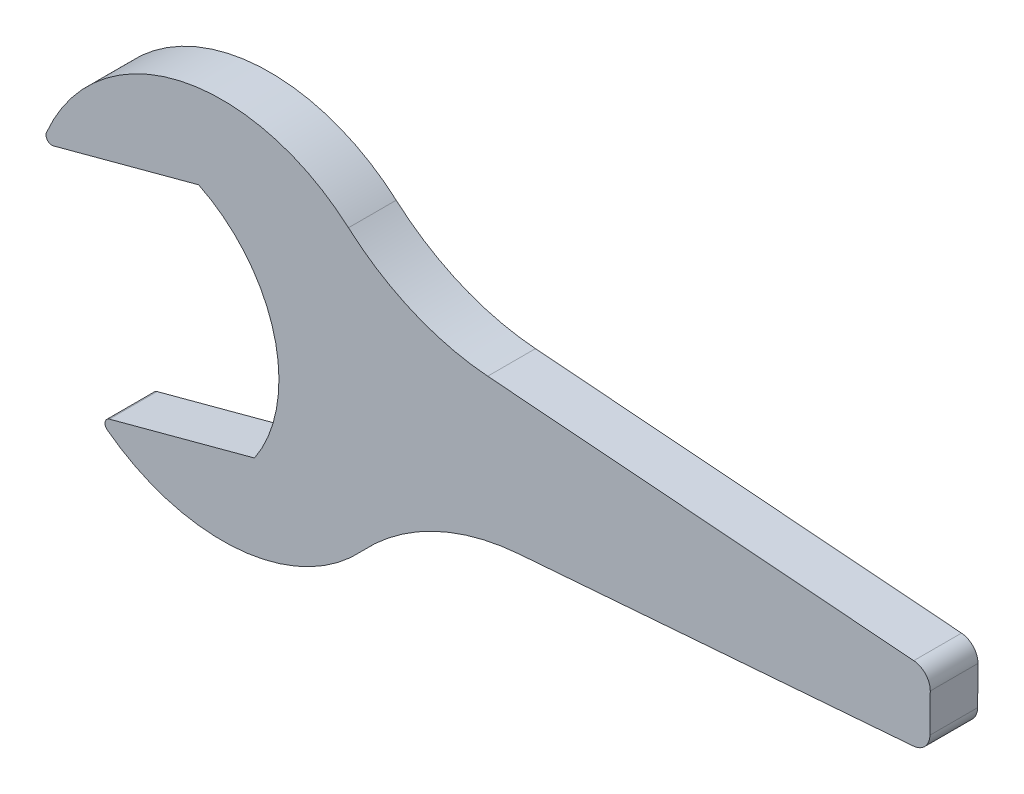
ISO-10303-21;
HEADER;
FILE_DESCRIPTION(('STEP AP214'),'2;1');
FILE_NAME('part.step','',(''),(''),'','','');
FILE_SCHEMA(('AUTOMOTIVE_DESIGN { 1 0 10303 214 1 1 1 1 }'));
ENDSEC;
DATA;
#1=APPLICATION_CONTEXT('core data for automotive mechanical design processes');
#2=APPLICATION_PROTOCOL_DEFINITION('international standard','automotive_design',2000,#1);
#3=PRODUCT_CONTEXT('',#1,'mechanical');
#4=PRODUCT('Part','Part','',(#3));
#5=PRODUCT_RELATED_PRODUCT_CATEGORY('part','',(#4));
#6=PRODUCT_DEFINITION_FORMATION('','',#4);
#7=PRODUCT_DEFINITION_CONTEXT('part definition',#1,'design');
#8=PRODUCT_DEFINITION('design','',#6,#7);
#9=PRODUCT_DEFINITION_SHAPE('','',#8);
#10=(LENGTH_UNIT() NAMED_UNIT(*) SI_UNIT(.MILLI.,.METRE.));
#11=(NAMED_UNIT(*) PLANE_ANGLE_UNIT() SI_UNIT($,.RADIAN.));
#12=(NAMED_UNIT(*) SI_UNIT($,.STERADIAN.) SOLID_ANGLE_UNIT());
#13=UNCERTAINTY_MEASURE_WITH_UNIT(LENGTH_MEASURE(1.E-05),#10,'distance_accuracy_value','');
#14=(GEOMETRIC_REPRESENTATION_CONTEXT(3) GLOBAL_UNCERTAINTY_ASSIGNED_CONTEXT((#13)) GLOBAL_UNIT_ASSIGNED_CONTEXT((#10,
#11,#12)) REPRESENTATION_CONTEXT('',''));
#15=CARTESIAN_POINT('',(0.,0.,0.));
#16=DIRECTION('',(0.,0.,1.));
#17=DIRECTION('',(1.,0.,0.));
#18=AXIS2_PLACEMENT_3D('',#15,#16,#17);
#19=CARTESIAN_POINT('',(550.,29.9775416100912,40.));
#20=DIRECTION('',(-0.999954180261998,0.00957274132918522,0.));
#21=DIRECTION('',(-0.00957274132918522,-0.999954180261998,0.));
#22=AXIS2_PLACEMENT_3D('',#19,#20,#21);
#23=PLANE('',#22);
#24=DIRECTION('',(0.00957274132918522,0.999954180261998,0.));
#25=VECTOR('',#24,1.);
#26=CARTESIAN_POINT('',(550.,29.9775416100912,0.));
#27=LINE('',#26,#25);
#28=CARTESIAN_POINT('',(549.557140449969,-16.2829017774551,0.));
#29=VERTEX_POINT('',#28);
#30=CARTESIAN_POINT('',(549.865918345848,15.9715734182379,0.));
#31=VERTEX_POINT('',#30);
#32=EDGE_CURVE('E171',#29,#31,#27,.T.);
#33=ORIENTED_EDGE('',*,*,#32,.T.);
#34=DIRECTION('',(0.,0.,-1.));
#35=VECTOR('',#34,1.);
#36=CARTESIAN_POINT('',(549.865918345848,15.9715734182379,40.));
#37=LINE('',#36,#35);
#38=CARTESIAN_POINT('',(549.865918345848,15.9715734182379,40.));
#39=VERTEX_POINT('',#38);
#40=EDGE_CURVE('E53',#31,#39,#37,.F.);
#41=ORIENTED_EDGE('',*,*,#40,.T.);
#42=DIRECTION('',(0.00957274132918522,0.999954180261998,0.));
#43=VECTOR('',#42,1.);
#44=CARTESIAN_POINT('',(550.,29.9775416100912,40.));
#45=LINE('',#44,#43);
#46=CARTESIAN_POINT('',(549.557140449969,-16.2829017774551,40.));
#47=VERTEX_POINT('',#46);
#48=EDGE_CURVE('E188',#47,#39,#45,.T.);
#49=ORIENTED_EDGE('',*,*,#48,.F.);
#50=DIRECTION('',(0.,0.,-1.));
#51=VECTOR('',#50,1.);
#52=CARTESIAN_POINT('',(549.557140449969,-16.2829017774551,40.));
#53=LINE('',#52,#51);
#54=EDGE_CURVE('E234',#47,#29,#53,.T.);
#55=ORIENTED_EDGE('',*,*,#54,.T.);
#56=EDGE_LOOP('',(#33,#41,#49,#55));
#57=FACE_BOUND('',#56,.T.);
#58=ADVANCED_FACE('F32',(#57),#23,.F.);
#59=CARTESIAN_POINT('',(96.7492438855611,65.4212925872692,40.));
#60=DIRECTION('',(-0.0779609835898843,-0.996956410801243,0.));
#61=DIRECTION('',(0.996956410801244,-0.0779609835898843,0.));
#62=AXIS2_PLACEMENT_3D('',#59,#60,#61);
#63=PLANE('',#62);
#64=DIRECTION('',(-0.996956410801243,0.0779609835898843,0.));
#65=VECTOR('',#64,1.);
#66=CARTESIAN_POINT('',(96.7492438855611,65.4212925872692,40.));
#67=LINE('',#66,#65);
#68=CARTESIAN_POINT('',(536.036020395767,31.0695107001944,40.));
#69=VERTEX_POINT('',#68);
#70=CARTESIAN_POINT('',(179.030249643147,58.9870011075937,40.));
#71=VERTEX_POINT('',#70);
#72=EDGE_CURVE('E241',#69,#71,#67,.T.);
#73=ORIENTED_EDGE('',*,*,#72,.F.);
#74=DIRECTION('',(0.,0.,-1.));
#75=VECTOR('',#74,1.);
#76=CARTESIAN_POINT('',(536.036020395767,31.0695107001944,40.));
#77=LINE('',#76,#75);
#78=CARTESIAN_POINT('',(536.036020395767,31.0695107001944,0.));
#79=VERTEX_POINT('',#78);
#80=EDGE_CURVE('E227',#69,#79,#77,.T.);
#81=ORIENTED_EDGE('',*,*,#80,.T.);
#82=DIRECTION('',(-0.996956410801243,0.0779609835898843,0.));
#83=VECTOR('',#82,1.);
#84=CARTESIAN_POINT('',(96.7492438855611,65.4212925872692,0.));
#85=LINE('',#84,#83);
#86=CARTESIAN_POINT('',(179.030249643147,58.9870011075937,0.));
#87=VERTEX_POINT('',#86);
#88=EDGE_CURVE('E173',#79,#87,#85,.T.);
#89=ORIENTED_EDGE('',*,*,#88,.T.);
#90=DIRECTION('',(0.,0.,1.));
#91=VECTOR('',#90,1.);
#92=CARTESIAN_POINT('',(179.030249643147,58.9870011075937,40.));
#93=LINE('',#92,#91);
#94=EDGE_CURVE('E215',#87,#71,#93,.T.);
#95=ORIENTED_EDGE('',*,*,#94,.T.);
#96=EDGE_LOOP('',(#73,#81,#89,#95));
#97=FACE_BOUND('',#96,.T.);
#98=ADVANCED_FACE('F245',(#97),#63,.F.);
#99=CARTESIAN_POINT('',(-43.4666621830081,-11.6468570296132,40.));
#100=DIRECTION('',(0.,0.,-1.));
#101=DIRECTION('',(-1.,0.,0.));
#102=AXIS2_PLACEMENT_3D('',#99,#100,#101);
#103=CYLINDRICAL_SURFACE('',#102,160.);
#104=CARTESIAN_POINT('',(-43.4666621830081,-11.6468570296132,40.));
#105=DIRECTION('',(0.,0.,1.));
#106=DIRECTION('',(1.,0.,0.));
#107=AXIS2_PLACEMENT_3D('',#104,#105,#106);
#108=CIRCLE('',#107,160.);
#109=CARTESIAN_POINT('',(62.3507193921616,108.364316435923,40.));
#110=VERTEX_POINT('',#109);
#111=CARTESIAN_POINT('',(-190.710310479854,50.957520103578,40.));
#112=VERTEX_POINT('',#111);
#113=EDGE_CURVE('E146',#110,#112,#108,.T.);
#114=ORIENTED_EDGE('',*,*,#113,.F.);
#115=DIRECTION('',(0.,0.,-1.));
#116=VECTOR('',#115,1.);
#117=CARTESIAN_POINT('',(62.3507193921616,108.364316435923,40.));
#118=LINE('',#117,#116);
#119=CARTESIAN_POINT('',(62.3507193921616,108.364316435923,0.));
#120=VERTEX_POINT('',#119);
#121=EDGE_CURVE('E212',#110,#120,#118,.T.);
#122=ORIENTED_EDGE('',*,*,#121,.T.);
#123=CARTESIAN_POINT('',(-43.4666621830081,-11.6468570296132,0.));
#124=DIRECTION('',(0.,0.,1.));
#125=DIRECTION('',(1.,0.,0.));
#126=AXIS2_PLACEMENT_3D('',#123,#124,#125);
#127=CIRCLE('',#126,160.);
#128=CARTESIAN_POINT('',(-190.710310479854,50.957520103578,0.));
#129=VERTEX_POINT('',#128);
#130=EDGE_CURVE('E175',#120,#129,#127,.T.);
#131=ORIENTED_EDGE('',*,*,#130,.T.);
#132=DIRECTION('',(0.,0.,-1.));
#133=VECTOR('',#132,1.);
#134=CARTESIAN_POINT('',(-190.710310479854,50.9575201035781,40.));
#135=LINE('',#134,#133);
#136=EDGE_CURVE('E204',#129,#112,#135,.F.);
#137=ORIENTED_EDGE('',*,*,#136,.T.);
#138=EDGE_LOOP('',(#114,#122,#131,#137));
#139=FACE_BOUND('',#138,.T.);
#140=ADVANCED_FACE('F289',(#139),#103,.T.);
#141=CARTESIAN_POINT('',(-194.339846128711,41.619289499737,40.));
#142=DIRECTION('',(-0.258819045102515,0.96592582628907,0.));
#143=DIRECTION('',(-0.96592582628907,-0.258819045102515,0.));
#144=AXIS2_PLACEMENT_3D('',#141,#142,#143);
#145=PLANE('',#144);
#146=DIRECTION('',(0.96592582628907,0.258819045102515,0.));
#147=VECTOR('',#146,1.);
#148=CARTESIAN_POINT('',(-194.339846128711,41.619289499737,40.));
#149=LINE('',#148,#147);
#150=CARTESIAN_POINT('',(-184.814851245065,44.1715041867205,40.));
#151=VERTEX_POINT('',#150);
#152=CARTESIAN_POINT('',(-63.2173676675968,76.7534517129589,40.));
#153=VERTEX_POINT('',#152);
#154=EDGE_CURVE('E134',#151,#153,#149,.T.);
#155=ORIENTED_EDGE('',*,*,#154,.F.);
#156=DIRECTION('',(0.,0.,-1.));
#157=VECTOR('',#156,1.);
#158=CARTESIAN_POINT('',(-184.814851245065,44.1715041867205,40.));
#159=LINE('',#158,#157);
#160=CARTESIAN_POINT('',(-184.814851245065,44.1715041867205,0.));
#161=VERTEX_POINT('',#160);
#162=EDGE_CURVE('E202',#151,#161,#159,.T.);
#163=ORIENTED_EDGE('',*,*,#162,.T.);
#164=DIRECTION('',(0.96592582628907,0.258819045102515,0.));
#165=VECTOR('',#164,1.);
#166=CARTESIAN_POINT('',(-194.339846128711,41.619289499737,0.));
#167=LINE('',#166,#165);
#168=CARTESIAN_POINT('',(-63.2173676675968,76.7534517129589,0.));
#169=VERTEX_POINT('',#168);
#170=EDGE_CURVE('E152',#161,#169,#167,.T.);
#171=ORIENTED_EDGE('',*,*,#170,.T.);
#172=DIRECTION('',(0.,0.,-1.));
#173=VECTOR('',#172,1.);
#174=CARTESIAN_POINT('',(-63.2173676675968,76.7534517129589,40.));
#175=LINE('',#174,#173);
#176=EDGE_CURVE('E149',#153,#169,#175,.T.);
#177=ORIENTED_EDGE('',*,*,#176,.F.);
#178=EDGE_LOOP('',(#155,#163,#171,#177));
#179=FACE_BOUND('',#178,.T.);
#180=ADVANCED_FACE('F150',(#179),#145,.F.);
#181=CARTESIAN_POINT('',(-115.911099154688,-31.0582854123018,40.));
#182=DIRECTION('',(0.,0.,-1.));
#183=DIRECTION('',(-1.,0.,0.));
#184=AXIS2_PLACEMENT_3D('',#181,#182,#183);
#185=CYLINDRICAL_SURFACE('',#184,120.);
#186=CARTESIAN_POINT('',(-115.911099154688,-31.0582854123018,0.));
#187=DIRECTION('',(0.,0.,-1.));
#188=DIRECTION('',(-1.,0.,0.));
#189=AXIS2_PLACEMENT_3D('',#186,#187,#188);
#190=CIRCLE('',#189,120.);
#191=CARTESIAN_POINT('',(-16.3711205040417,-98.0791228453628,0.));
#192=VERTEX_POINT('',#191);
#193=EDGE_CURVE('E178',#169,#192,#190,.T.);
#194=ORIENTED_EDGE('',*,*,#193,.T.);
#195=DIRECTION('',(0.,0.,-1.));
#196=VECTOR('',#195,1.);
#197=CARTESIAN_POINT('',(-16.3711205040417,-98.0791228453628,40.));
#198=LINE('',#197,#196);
#199=CARTESIAN_POINT('',(-16.3711205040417,-98.0791228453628,40.));
#200=VERTEX_POINT('',#199);
#201=EDGE_CURVE('E156',#200,#192,#198,.T.);
#202=ORIENTED_EDGE('',*,*,#201,.F.);
#203=CARTESIAN_POINT('',(-115.911099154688,-31.0582854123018,40.));
#204=DIRECTION('',(0.,0.,-1.));
#205=DIRECTION('',(-1.,0.,0.));
#206=AXIS2_PLACEMENT_3D('',#203,#204,#205);
#207=CIRCLE('',#206,120.);
#208=EDGE_CURVE('E139',#153,#200,#207,.T.);
#209=ORIENTED_EDGE('',*,*,#208,.F.);
#210=ORIENTED_EDGE('',*,*,#176,.T.);
#211=EDGE_LOOP('',(#194,#202,#209,#210));
#212=FACE_BOUND('',#211,.T.);
#213=ADVANCED_FACE('F158',(#212),#185,.F.);
#214=CARTESIAN_POINT('',(-147.493598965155,-133.213285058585,40.));
#215=DIRECTION('',(0.258819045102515,-0.96592582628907,0.));
#216=DIRECTION('',(0.96592582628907,0.258819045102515,0.));
#217=AXIS2_PLACEMENT_3D('',#214,#215,#216);
#218=PLANE('',#217);
#219=DIRECTION('',(-0.96592582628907,-0.258819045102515,0.));
#220=VECTOR('',#219,1.);
#221=CARTESIAN_POINT('',(-147.493598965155,-133.213285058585,0.));
#222=LINE('',#221,#220);
#223=CARTESIAN_POINT('',(-137.96860408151,-130.661070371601,0.));
#224=VERTEX_POINT('',#223);
#225=EDGE_CURVE('E180',#192,#224,#222,.T.);
#226=ORIENTED_EDGE('',*,*,#225,.T.);
#227=DIRECTION('',(0.,0.,-1.));
#228=VECTOR('',#227,1.);
#229=CARTESIAN_POINT('',(-137.96860408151,-130.661070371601,40.));
#230=LINE('',#229,#228);
#231=CARTESIAN_POINT('',(-137.96860408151,-130.661070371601,40.));
#232=VERTEX_POINT('',#231);
#233=EDGE_CURVE('E197',#224,#232,#230,.F.);
#234=ORIENTED_EDGE('',*,*,#233,.T.);
#235=DIRECTION('',(-0.96592582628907,-0.258819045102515,0.));
#236=VECTOR('',#235,1.);
#237=CARTESIAN_POINT('',(-147.493598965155,-133.213285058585,40.));
#238=LINE('',#237,#236);
#239=EDGE_CURVE('E161',#200,#232,#238,.T.);
#240=ORIENTED_EDGE('',*,*,#239,.F.);
#241=ORIENTED_EDGE('',*,*,#201,.T.);
#242=EDGE_LOOP('',(#226,#234,#240,#241));
#243=FACE_BOUND('',#242,.T.);
#244=ADVANCED_FACE('F275',(#243),#218,.F.);
#245=CARTESIAN_POINT('',(-43.4666621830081,-11.6468570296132,40.));
#246=DIRECTION('',(0.,0.,-1.));
#247=DIRECTION('',(-1.,0.,0.));
#248=AXIS2_PLACEMENT_3D('',#245,#246,#247);
#249=CYLINDRICAL_SURFACE('',#248,160.);
#250=CARTESIAN_POINT('',(-43.4666621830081,-11.6468570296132,0.));
#251=DIRECTION('',(0.,0.,1.));
#252=DIRECTION('',(1.,0.,0.));
#253=AXIS2_PLACEMENT_3D('',#250,#251,#252);
#254=CIRCLE('',#253,160.);
#255=CARTESIAN_POINT('',(-139.681213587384,-139.48566216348,0.));
#256=VERTEX_POINT('',#255);
#257=CARTESIAN_POINT('',(73.8878644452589,-120.403075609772,0.));
#258=VERTEX_POINT('',#257);
#259=EDGE_CURVE('E183',#256,#258,#254,.T.);
#260=ORIENTED_EDGE('',*,*,#259,.T.);
#261=DIRECTION('',(0.,0.,-1.));
#262=VECTOR('',#261,1.);
#263=CARTESIAN_POINT('',(73.8878644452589,-120.403075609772,40.));
#264=LINE('',#263,#262);
#265=CARTESIAN_POINT('',(73.8878644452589,-120.403075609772,40.));
#266=VERTEX_POINT('',#265);
#267=EDGE_CURVE('E210',#258,#266,#264,.F.);
#268=ORIENTED_EDGE('',*,*,#267,.T.);
#269=CARTESIAN_POINT('',(-43.4666621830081,-11.6468570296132,40.));
#270=DIRECTION('',(0.,0.,1.));
#271=DIRECTION('',(1.,0.,0.));
#272=AXIS2_PLACEMENT_3D('',#269,#270,#271);
#273=CIRCLE('',#272,160.);
#274=CARTESIAN_POINT('',(-139.681213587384,-139.48566216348,40.));
#275=VERTEX_POINT('',#274);
#276=EDGE_CURVE('E163',#275,#266,#273,.T.);
#277=ORIENTED_EDGE('',*,*,#276,.F.);
#278=DIRECTION('',(0.,0.,-1.));
#279=VECTOR('',#278,1.);
#280=CARTESIAN_POINT('',(-139.681213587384,-139.48566216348,40.));
#281=LINE('',#280,#279);
#282=EDGE_CURVE('E155',#275,#256,#281,.T.);
#283=ORIENTED_EDGE('',*,*,#282,.T.);
#284=EDGE_LOOP('',(#260,#268,#277,#283));
#285=FACE_BOUND('',#284,.T.);
#286=ADVANCED_FACE('F266',(#285),#249,.T.);
#287=CARTESIAN_POINT('',(549.425609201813,-30.0224583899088,40.));
#288=DIRECTION('',(-0.0779609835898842,0.996956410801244,0.));
#289=DIRECTION('',(-0.996956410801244,-0.0779609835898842,0.));
#290=AXIS2_PLACEMENT_3D('',#287,#288,#289);
#291=PLANE('',#290);
#292=DIRECTION('',(0.996956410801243,0.0779609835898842,0.));
#293=VECTOR('',#292,1.);
#294=CARTESIAN_POINT('',(549.425609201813,-30.0224583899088,0.));
#295=LINE('',#294,#293);
#296=CARTESIAN_POINT('',(204.988826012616,-56.9570666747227,0.));
#297=VERTEX_POINT('',#296);
#298=CARTESIAN_POINT('',(535.727242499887,-31.093656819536,0.));
#299=VERTEX_POINT('',#298);
#300=EDGE_CURVE('E186',#297,#299,#295,.T.);
#301=ORIENTED_EDGE('',*,*,#300,.T.);
#302=DIRECTION('',(0.,0.,-1.));
#303=VECTOR('',#302,1.);
#304=CARTESIAN_POINT('',(535.727242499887,-31.093656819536,40.));
#305=LINE('',#304,#303);
#306=CARTESIAN_POINT('',(535.727242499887,-31.093656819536,40.));
#307=VERTEX_POINT('',#306);
#308=EDGE_CURVE('E11',#299,#307,#305,.F.);
#309=ORIENTED_EDGE('',*,*,#308,.T.);
#310=DIRECTION('',(0.996956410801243,0.0779609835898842,0.));
#311=VECTOR('',#310,1.);
#312=CARTESIAN_POINT('',(549.425609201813,-30.0224583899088,40.));
#313=LINE('',#312,#311);
#314=CARTESIAN_POINT('',(204.988826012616,-56.9570666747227,40.));
#315=VERTEX_POINT('',#314);
#316=EDGE_CURVE('E169',#315,#307,#313,.T.);
#317=ORIENTED_EDGE('',*,*,#316,.F.);
#318=DIRECTION('',(0.,0.,1.));
#319=VECTOR('',#318,1.);
#320=CARTESIAN_POINT('',(204.988826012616,-56.9570666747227,0.));
#321=LINE('',#320,#319);
#322=EDGE_CURVE('E207',#315,#297,#321,.F.);
#323=ORIENTED_EDGE('',*,*,#322,.T.);
#324=EDGE_LOOP('',(#301,#309,#317,#323));
#325=FACE_BOUND('',#324,.T.);
#326=ADVANCED_FACE('F258',(#325),#291,.F.);
#327=CARTESIAN_POINT('',(-43.4666621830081,-11.6468570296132,40.));
#328=DIRECTION('',(0.,0.,1.));
#329=DIRECTION('',(1.,0.,0.));
#330=AXIS2_PLACEMENT_3D('',#327,#328,#329);
#331=PLANE('',#330);
#332=ORIENTED_EDGE('',*,*,#48,.T.);
#333=CARTESIAN_POINT('',(534.866605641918,16.1151645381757,40.));
#334=DIRECTION('',(0.,0.,1.));
#335=DIRECTION('',(1.,0.,0.));
#336=AXIS2_PLACEMENT_3D('',#333,#334,#335);
#337=CIRCLE('',#336,15.);
#338=EDGE_CURVE('E40',#39,#69,#337,.T.);
#339=ORIENTED_EDGE('',*,*,#338,.T.);
#340=ORIENTED_EDGE('',*,*,#72,.T.);
#341=CARTESIAN_POINT('',(194.622446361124,258.378283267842,40.));
#342=DIRECTION('',(0.,0.,1.));
#343=DIRECTION('',(1.,0.,0.));
#344=AXIS2_PLACEMENT_3D('',#341,#342,#343);
#345=CIRCLE('',#344,200.);
#346=EDGE_CURVE('E225',#71,#110,#345,.F.);
#347=ORIENTED_EDGE('',*,*,#346,.T.);
#348=ORIENTED_EDGE('',*,*,#113,.T.);
#349=CARTESIAN_POINT('',(-186.108946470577,49.0011333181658,40.));
#350=DIRECTION('',(0.,0.,1.));
#351=DIRECTION('',(1.,0.,0.));
#352=AXIS2_PLACEMENT_3D('',#349,#350,#351);
#353=CIRCLE('',#352,5.);
#354=EDGE_CURVE('E142',#112,#151,#353,.T.);
#355=ORIENTED_EDGE('',*,*,#354,.T.);
#356=ORIENTED_EDGE('',*,*,#154,.T.);
#357=ORIENTED_EDGE('',*,*,#208,.T.);
#358=ORIENTED_EDGE('',*,*,#239,.T.);
#359=CARTESIAN_POINT('',(-136.674508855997,-135.490699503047,40.));
#360=DIRECTION('',(0.,0.,1.));
#361=DIRECTION('',(1.,0.,0.));
#362=AXIS2_PLACEMENT_3D('',#359,#360,#361);
#363=CIRCLE('',#362,5.);
#364=EDGE_CURVE('E200',#232,#275,#363,.T.);
#365=ORIENTED_EDGE('',*,*,#364,.T.);
#366=ORIENTED_EDGE('',*,*,#276,.T.);
#367=CARTESIAN_POINT('',(220.581022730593,-256.348348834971,40.));
#368=DIRECTION('',(0.,0.,1.));
#369=DIRECTION('',(1.,0.,0.));
#370=AXIS2_PLACEMENT_3D('',#367,#368,#369);
#371=CIRCLE('',#370,200.);
#372=EDGE_CURVE('E220',#266,#315,#371,.F.);
#373=ORIENTED_EDGE('',*,*,#372,.T.);
#374=ORIENTED_EDGE('',*,*,#316,.T.);
#375=CARTESIAN_POINT('',(534.557827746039,-16.1393106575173,40.));
#376=DIRECTION('',(0.,0.,1.));
#377=DIRECTION('',(1.,0.,0.));
#378=AXIS2_PLACEMENT_3D('',#375,#376,#377);
#379=CIRCLE('',#378,15.);
#380=EDGE_CURVE('E238',#307,#47,#379,.T.);
#381=ORIENTED_EDGE('',*,*,#380,.T.);
#382=EDGE_LOOP('',(#332,#339,#340,#347,#348,#355,#356,#357,#358,#365,#366,#373,#374,#381));
#383=FACE_BOUND('',#382,.T.);
#384=ADVANCED_FACE('F136',(#383),#331,.T.);
#385=CARTESIAN_POINT('',(-43.4666621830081,-11.6468570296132,0.));
#386=DIRECTION('',(0.,0.,1.));
#387=DIRECTION('',(1.,0.,0.));
#388=AXIS2_PLACEMENT_3D('',#385,#386,#387);
#389=PLANE('',#388);
#390=ORIENTED_EDGE('',*,*,#88,.F.);
#391=CARTESIAN_POINT('',(534.866605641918,16.1151645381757,0.));
#392=DIRECTION('',(0.,0.,1.));
#393=DIRECTION('',(1.,0.,0.));
#394=AXIS2_PLACEMENT_3D('',#391,#392,#393);
#395=CIRCLE('',#394,15.);
#396=EDGE_CURVE('E232',#79,#31,#395,.F.);
#397=ORIENTED_EDGE('',*,*,#396,.T.);
#398=ORIENTED_EDGE('',*,*,#32,.F.);
#399=CARTESIAN_POINT('',(534.557827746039,-16.1393106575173,0.));
#400=DIRECTION('',(0.,0.,1.));
#401=DIRECTION('',(1.,0.,0.));
#402=AXIS2_PLACEMENT_3D('',#399,#400,#401);
#403=CIRCLE('',#402,15.);
#404=EDGE_CURVE('E230',#29,#299,#403,.F.);
#405=ORIENTED_EDGE('',*,*,#404,.T.);
#406=ORIENTED_EDGE('',*,*,#300,.F.);
#407=CARTESIAN_POINT('',(220.581022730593,-256.348348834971,0.));
#408=DIRECTION('',(0.,0.,1.));
#409=DIRECTION('',(1.,0.,0.));
#410=AXIS2_PLACEMENT_3D('',#407,#408,#409);
#411=CIRCLE('',#410,200.);
#412=EDGE_CURVE('E218',#297,#258,#411,.T.);
#413=ORIENTED_EDGE('',*,*,#412,.T.);
#414=ORIENTED_EDGE('',*,*,#259,.F.);
#415=CARTESIAN_POINT('',(-136.674508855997,-135.490699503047,0.));
#416=DIRECTION('',(0.,0.,1.));
#417=DIRECTION('',(1.,0.,0.));
#418=AXIS2_PLACEMENT_3D('',#415,#416,#417);
#419=CIRCLE('',#418,5.);
#420=EDGE_CURVE('E195',#256,#224,#419,.F.);
#421=ORIENTED_EDGE('',*,*,#420,.T.);
#422=ORIENTED_EDGE('',*,*,#225,.F.);
#423=ORIENTED_EDGE('',*,*,#193,.F.);
#424=ORIENTED_EDGE('',*,*,#170,.F.);
#425=CARTESIAN_POINT('',(-186.108946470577,49.0011333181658,0.));
#426=DIRECTION('',(0.,0.,1.));
#427=DIRECTION('',(1.,0.,0.));
#428=AXIS2_PLACEMENT_3D('',#425,#426,#427);
#429=CIRCLE('',#428,5.);
#430=EDGE_CURVE('E192',#161,#129,#429,.F.);
#431=ORIENTED_EDGE('',*,*,#430,.T.);
#432=ORIENTED_EDGE('',*,*,#130,.F.);
#433=CARTESIAN_POINT('',(194.622446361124,258.378283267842,0.));
#434=DIRECTION('',(0.,0.,1.));
#435=DIRECTION('',(1.,0.,0.));
#436=AXIS2_PLACEMENT_3D('',#433,#434,#435);
#437=CIRCLE('',#436,200.);
#438=EDGE_CURVE('E222',#120,#87,#437,.T.);
#439=ORIENTED_EDGE('',*,*,#438,.T.);
#440=EDGE_LOOP('',(#390,#397,#398,#405,#406,#413,#414,#421,#422,#423,#424,#431,#432,#439));
#441=FACE_BOUND('',#440,.T.);
#442=ADVANCED_FACE('F253',(#441),#389,.F.);
#443=CARTESIAN_POINT('',(-136.674508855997,-135.490699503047,40.));
#444=DIRECTION('',(0.,0.,-1.));
#445=DIRECTION('',(-1.,0.,0.));
#446=AXIS2_PLACEMENT_3D('',#443,#444,#445);
#447=CYLINDRICAL_SURFACE('',#446,5.);
#448=ORIENTED_EDGE('',*,*,#364,.F.);
#449=ORIENTED_EDGE('',*,*,#233,.F.);
#450=ORIENTED_EDGE('',*,*,#420,.F.);
#451=ORIENTED_EDGE('',*,*,#282,.F.);
#452=EDGE_LOOP('',(#448,#449,#450,#451));
#453=FACE_BOUND('',#452,.T.);
#454=ADVANCED_FACE('F271',(#453),#447,.T.);
#455=CARTESIAN_POINT('',(-186.108946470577,49.0011333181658,40.));
#456=DIRECTION('',(0.,0.,-1.));
#457=DIRECTION('',(-1.,0.,0.));
#458=AXIS2_PLACEMENT_3D('',#455,#456,#457);
#459=CYLINDRICAL_SURFACE('',#458,5.);
#460=ORIENTED_EDGE('',*,*,#354,.F.);
#461=ORIENTED_EDGE('',*,*,#136,.F.);
#462=ORIENTED_EDGE('',*,*,#430,.F.);
#463=ORIENTED_EDGE('',*,*,#162,.F.);
#464=EDGE_LOOP('',(#460,#461,#462,#463));
#465=FACE_BOUND('',#464,.T.);
#466=ADVANCED_FACE('F295',(#465),#459,.T.);
#467=CARTESIAN_POINT('',(220.581022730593,-256.348348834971,40.));
#468=DIRECTION('',(0.,0.,-1.));
#469=DIRECTION('',(-1.,0.,0.));
#470=AXIS2_PLACEMENT_3D('',#467,#468,#469);
#471=CYLINDRICAL_SURFACE('',#470,200.);
#472=ORIENTED_EDGE('',*,*,#372,.F.);
#473=ORIENTED_EDGE('',*,*,#267,.F.);
#474=ORIENTED_EDGE('',*,*,#412,.F.);
#475=ORIENTED_EDGE('',*,*,#322,.F.);
#476=EDGE_LOOP('',(#472,#473,#474,#475));
#477=FACE_BOUND('',#476,.T.);
#478=ADVANCED_FACE('F262',(#477),#471,.F.);
#479=CARTESIAN_POINT('',(194.622446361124,258.378283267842,40.));
#480=DIRECTION('',(0.,0.,-1.));
#481=DIRECTION('',(-1.,0.,0.));
#482=AXIS2_PLACEMENT_3D('',#479,#480,#481);
#483=CYLINDRICAL_SURFACE('',#482,200.);
#484=ORIENTED_EDGE('',*,*,#346,.F.);
#485=ORIENTED_EDGE('',*,*,#94,.F.);
#486=ORIENTED_EDGE('',*,*,#438,.F.);
#487=ORIENTED_EDGE('',*,*,#121,.F.);
#488=EDGE_LOOP('',(#484,#485,#486,#487));
#489=FACE_BOUND('',#488,.T.);
#490=ADVANCED_FACE('F301',(#489),#483,.F.);
#491=CARTESIAN_POINT('',(534.866605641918,16.1151645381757,40.));
#492=DIRECTION('',(0.,0.,-1.));
#493=DIRECTION('',(-1.,0.,0.));
#494=AXIS2_PLACEMENT_3D('',#491,#492,#493);
#495=CYLINDRICAL_SURFACE('',#494,15.);
#496=ORIENTED_EDGE('',*,*,#338,.F.);
#497=ORIENTED_EDGE('',*,*,#40,.F.);
#498=ORIENTED_EDGE('',*,*,#396,.F.);
#499=ORIENTED_EDGE('',*,*,#80,.F.);
#500=EDGE_LOOP('',(#496,#497,#498,#499));
#501=FACE_BOUND('',#500,.T.);
#502=ADVANCED_FACE('F250',(#501),#495,.T.);
#503=CARTESIAN_POINT('',(534.557827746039,-16.1393106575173,40.));
#504=DIRECTION('',(0.,0.,-1.));
#505=DIRECTION('',(-1.,0.,0.));
#506=AXIS2_PLACEMENT_3D('',#503,#504,#505);
#507=CYLINDRICAL_SURFACE('',#506,15.);
#508=ORIENTED_EDGE('',*,*,#380,.F.);
#509=ORIENTED_EDGE('',*,*,#308,.F.);
#510=ORIENTED_EDGE('',*,*,#404,.F.);
#511=ORIENTED_EDGE('',*,*,#54,.F.);
#512=EDGE_LOOP('',(#508,#509,#510,#511));
#513=FACE_BOUND('',#512,.T.);
#514=ADVANCED_FACE('F34',(#513),#507,.T.);
#515=CLOSED_SHELL('',(#58,#98,#140,#180,#213,#244,#286,#326,#384,#442,#454,#466,#478,#490,#502,#514));
#516=MANIFOLD_SOLID_BREP('B2',#515);
#517=ADVANCED_BREP_SHAPE_REPRESENTATION('',(#18,#516),#14);
#518=SHAPE_DEFINITION_REPRESENTATION(#9,#517);
ENDSEC;
END-ISO-10303-21;
